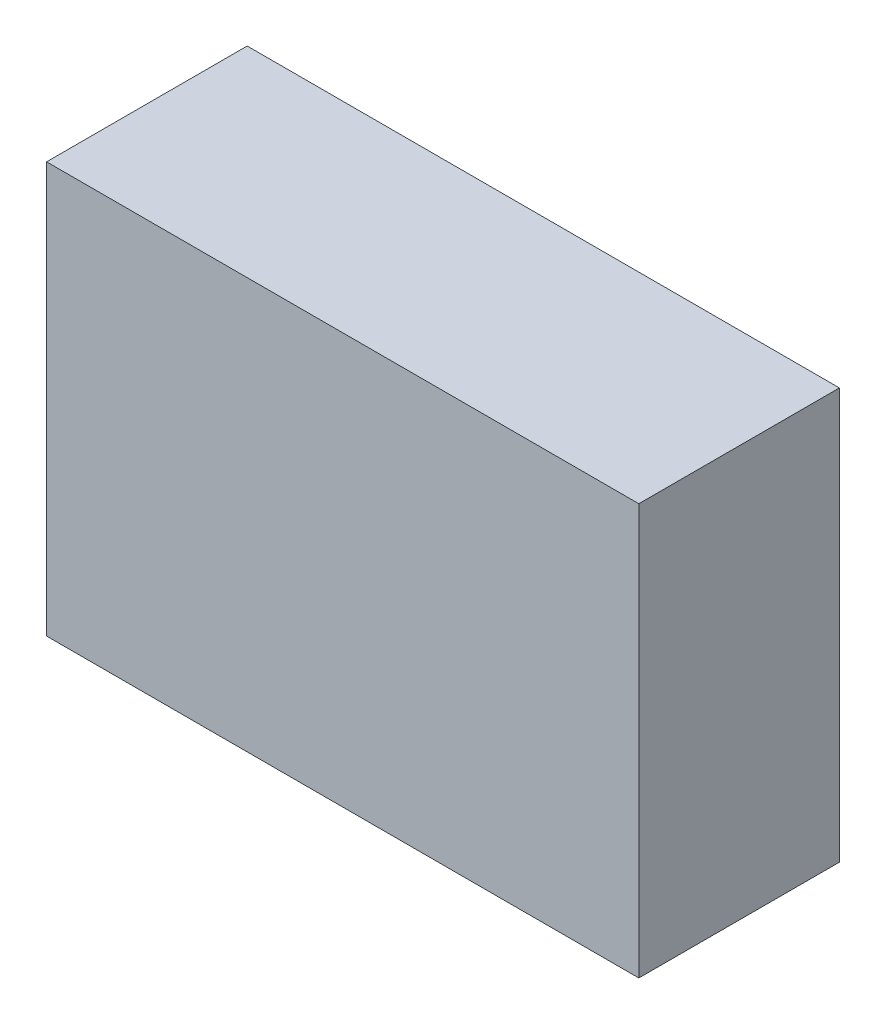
ISO-10303-21;
HEADER;
FILE_DESCRIPTION(('STEP AP214'),'2;1');
FILE_NAME('part.step','',(''),(''),'','','');
FILE_SCHEMA(('AUTOMOTIVE_DESIGN { 1 0 10303 214 1 1 1 1 }'));
ENDSEC;
DATA;
#1=APPLICATION_CONTEXT('core data for automotive mechanical design processes');
#2=APPLICATION_PROTOCOL_DEFINITION('international standard','automotive_design',2000,#1);
#3=PRODUCT_CONTEXT('',#1,'mechanical');
#4=PRODUCT('Part','Part','',(#3));
#5=PRODUCT_RELATED_PRODUCT_CATEGORY('part','',(#4));
#6=PRODUCT_DEFINITION_FORMATION('','',#4);
#7=PRODUCT_DEFINITION_CONTEXT('part definition',#1,'design');
#8=PRODUCT_DEFINITION('design','',#6,#7);
#9=PRODUCT_DEFINITION_SHAPE('','',#8);
#10=(LENGTH_UNIT() NAMED_UNIT(*) SI_UNIT(.MILLI.,.METRE.));
#11=(NAMED_UNIT(*) PLANE_ANGLE_UNIT() SI_UNIT($,.RADIAN.));
#12=(NAMED_UNIT(*) SI_UNIT($,.STERADIAN.) SOLID_ANGLE_UNIT());
#13=UNCERTAINTY_MEASURE_WITH_UNIT(LENGTH_MEASURE(1.E-05),#10,'distance_accuracy_value','');
#14=(GEOMETRIC_REPRESENTATION_CONTEXT(3) GLOBAL_UNCERTAINTY_ASSIGNED_CONTEXT((#13)) GLOBAL_UNIT_ASSIGNED_CONTEXT((#10,
#11,#12)) REPRESENTATION_CONTEXT('',''));
#15=CARTESIAN_POINT('',(0.,0.,0.));
#16=DIRECTION('',(0.,0.,1.));
#17=DIRECTION('',(1.,0.,0.));
#18=AXIS2_PLACEMENT_3D('',#15,#16,#17);
#19=CARTESIAN_POINT('',(31.,21.5,21.));
#20=DIRECTION('',(-1.,0.,0.));
#21=DIRECTION('',(0.,-1.,0.));
#22=AXIS2_PLACEMENT_3D('',#19,#20,#21);
#23=PLANE('',#22);
#24=DIRECTION('',(0.,1.,0.));
#25=VECTOR('',#24,1.);
#26=CARTESIAN_POINT('',(31.,21.5,0.));
#27=LINE('',#26,#25);
#28=CARTESIAN_POINT('',(31.,-21.5,0.));
#29=VERTEX_POINT('',#28);
#30=CARTESIAN_POINT('',(31.,21.5,0.));
#31=VERTEX_POINT('',#30);
#32=EDGE_CURVE('E107',#29,#31,#27,.T.);
#33=ORIENTED_EDGE('',*,*,#32,.T.);
#34=DIRECTION('',(0.,0.,-1.));
#35=VECTOR('',#34,1.);
#36=CARTESIAN_POINT('',(31.,21.5,21.));
#37=LINE('',#36,#35);
#38=CARTESIAN_POINT('',(31.,21.5,21.));
#39=VERTEX_POINT('',#38);
#40=EDGE_CURVE('E11',#39,#31,#37,.T.);
#41=ORIENTED_EDGE('',*,*,#40,.F.);
#42=DIRECTION('',(0.,1.,0.));
#43=VECTOR('',#42,1.);
#44=CARTESIAN_POINT('',(31.,21.5,21.));
#45=LINE('',#44,#43);
#46=CARTESIAN_POINT('',(31.,-21.5,21.));
#47=VERTEX_POINT('',#46);
#48=EDGE_CURVE('E91',#47,#39,#45,.T.);
#49=ORIENTED_EDGE('',*,*,#48,.F.);
#50=DIRECTION('',(0.,0.,-1.));
#51=VECTOR('',#50,1.);
#52=CARTESIAN_POINT('',(31.,-21.5,21.));
#53=LINE('',#52,#51);
#54=EDGE_CURVE('E103',#47,#29,#53,.T.);
#55=ORIENTED_EDGE('',*,*,#54,.T.);
#56=EDGE_LOOP('',(#33,#41,#49,#55));
#57=FACE_BOUND('',#56,.T.);
#58=ADVANCED_FACE('F39',(#57),#23,.F.);
#59=CARTESIAN_POINT('',(-31.,21.5,21.));
#60=DIRECTION('',(0.,-1.,0.));
#61=DIRECTION('',(0.,0.,-1.));
#62=AXIS2_PLACEMENT_3D('',#59,#60,#61);
#63=PLANE('',#62);
#64=DIRECTION('',(-1.,0.,0.));
#65=VECTOR('',#64,1.);
#66=CARTESIAN_POINT('',(-31.,21.5,0.));
#67=LINE('',#66,#65);
#68=CARTESIAN_POINT('',(-31.,21.5,0.));
#69=VERTEX_POINT('',#68);
#70=EDGE_CURVE('E96',#31,#69,#67,.T.);
#71=ORIENTED_EDGE('',*,*,#70,.T.);
#72=DIRECTION('',(0.,0.,-1.));
#73=VECTOR('',#72,1.);
#74=CARTESIAN_POINT('',(-31.,21.5,21.));
#75=LINE('',#74,#73);
#76=CARTESIAN_POINT('',(-31.,21.5,21.));
#77=VERTEX_POINT('',#76);
#78=EDGE_CURVE('E48',#77,#69,#75,.T.);
#79=ORIENTED_EDGE('',*,*,#78,.F.);
#80=DIRECTION('',(-1.,0.,0.));
#81=VECTOR('',#80,1.);
#82=CARTESIAN_POINT('',(-31.,21.5,21.));
#83=LINE('',#82,#81);
#84=EDGE_CURVE('E86',#39,#77,#83,.T.);
#85=ORIENTED_EDGE('',*,*,#84,.F.);
#86=ORIENTED_EDGE('',*,*,#40,.T.);
#87=EDGE_LOOP('',(#71,#79,#85,#86));
#88=FACE_BOUND('',#87,.T.);
#89=ADVANCED_FACE('F95',(#88),#63,.F.);
#90=CARTESIAN_POINT('',(-31.,21.5,21.));
#91=DIRECTION('',(1.,0.,0.));
#92=DIRECTION('',(0.,1.,0.));
#93=AXIS2_PLACEMENT_3D('',#90,#91,#92);
#94=PLANE('',#93);
#95=DIRECTION('',(0.,-1.,0.));
#96=VECTOR('',#95,1.);
#97=CARTESIAN_POINT('',(-31.,21.5,0.));
#98=LINE('',#97,#96);
#99=CARTESIAN_POINT('',(-31.,-21.5,0.));
#100=VERTEX_POINT('',#99);
#101=EDGE_CURVE('E73',#69,#100,#98,.T.);
#102=ORIENTED_EDGE('',*,*,#101,.T.);
#103=DIRECTION('',(0.,0.,-1.));
#104=VECTOR('',#103,1.);
#105=CARTESIAN_POINT('',(-31.,-21.5,21.));
#106=LINE('',#105,#104);
#107=CARTESIAN_POINT('',(-31.,-21.5,21.));
#108=VERTEX_POINT('',#107);
#109=EDGE_CURVE('E98',#108,#100,#106,.T.);
#110=ORIENTED_EDGE('',*,*,#109,.F.);
#111=DIRECTION('',(0.,-1.,0.));
#112=VECTOR('',#111,1.);
#113=CARTESIAN_POINT('',(-31.,21.5,21.));
#114=LINE('',#113,#112);
#115=EDGE_CURVE('E89',#77,#108,#114,.T.);
#116=ORIENTED_EDGE('',*,*,#115,.F.);
#117=ORIENTED_EDGE('',*,*,#78,.T.);
#118=EDGE_LOOP('',(#102,#110,#116,#117));
#119=FACE_BOUND('',#118,.T.);
#120=ADVANCED_FACE('F99',(#119),#94,.F.);
#121=CARTESIAN_POINT('',(-31.,-21.5,21.));
#122=DIRECTION('',(0.,1.,0.));
#123=DIRECTION('',(0.,0.,1.));
#124=AXIS2_PLACEMENT_3D('',#121,#122,#123);
#125=PLANE('',#124);
#126=DIRECTION('',(1.,0.,0.));
#127=VECTOR('',#126,1.);
#128=CARTESIAN_POINT('',(-31.,-21.5,0.));
#129=LINE('',#128,#127);
#130=EDGE_CURVE('E79',#100,#29,#129,.T.);
#131=ORIENTED_EDGE('',*,*,#130,.T.);
#132=ORIENTED_EDGE('',*,*,#54,.F.);
#133=DIRECTION('',(1.,0.,0.));
#134=VECTOR('',#133,1.);
#135=CARTESIAN_POINT('',(-31.,-21.5,21.));
#136=LINE('',#135,#134);
#137=EDGE_CURVE('E56',#108,#47,#136,.T.);
#138=ORIENTED_EDGE('',*,*,#137,.F.);
#139=ORIENTED_EDGE('',*,*,#109,.T.);
#140=EDGE_LOOP('',(#131,#132,#138,#139));
#141=FACE_BOUND('',#140,.T.);
#142=ADVANCED_FACE('F120',(#141),#125,.F.);
#143=CARTESIAN_POINT('',(0.,0.,21.));
#144=DIRECTION('',(0.,0.,1.));
#145=DIRECTION('',(1.,0.,0.));
#146=AXIS2_PLACEMENT_3D('',#143,#144,#145);
#147=PLANE('',#146);
#148=ORIENTED_EDGE('',*,*,#48,.T.);
#149=ORIENTED_EDGE('',*,*,#84,.T.);
#150=ORIENTED_EDGE('',*,*,#115,.T.);
#151=ORIENTED_EDGE('',*,*,#137,.T.);
#152=EDGE_LOOP('',(#148,#149,#150,#151));
#153=FACE_BOUND('',#152,.T.);
#154=ADVANCED_FACE('F87',(#153),#147,.T.);
#155=CARTESIAN_POINT('',(0.,0.,0.));
#156=DIRECTION('',(0.,0.,1.));
#157=DIRECTION('',(1.,0.,0.));
#158=AXIS2_PLACEMENT_3D('',#155,#156,#157);
#159=PLANE('',#158);
#160=ORIENTED_EDGE('',*,*,#32,.F.);
#161=ORIENTED_EDGE('',*,*,#130,.F.);
#162=ORIENTED_EDGE('',*,*,#101,.F.);
#163=ORIENTED_EDGE('',*,*,#70,.F.);
#164=EDGE_LOOP('',(#160,#161,#162,#163));
#165=FACE_BOUND('',#164,.T.);
#166=ADVANCED_FACE('F123',(#165),#159,.F.);
#167=CLOSED_SHELL('',(#58,#89,#120,#142,#154,#166));
#168=MANIFOLD_SOLID_BREP('B2',#167);
#169=ADVANCED_BREP_SHAPE_REPRESENTATION('',(#18,#168),#14);
#170=SHAPE_DEFINITION_REPRESENTATION(#9,#169);
ENDSEC;
END-ISO-10303-21;
